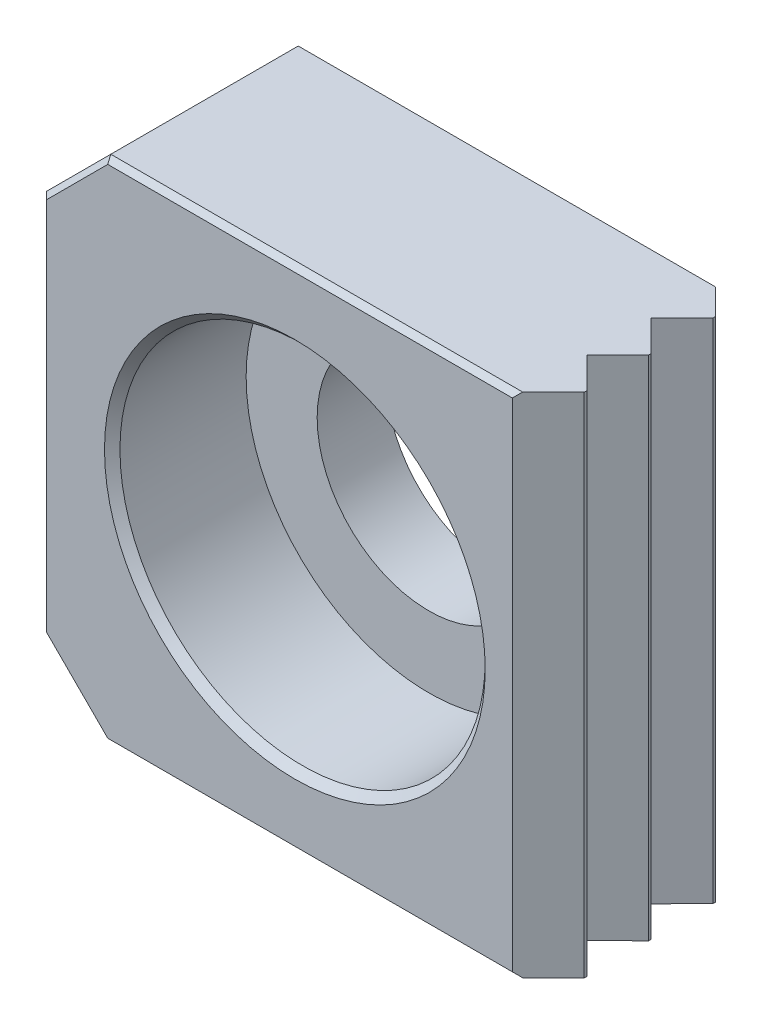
ISO-10303-21;
HEADER;
FILE_DESCRIPTION(('STEP AP214'),'2;1');
FILE_NAME('part.step','',(''),(''),'','','');
FILE_SCHEMA(('AUTOMOTIVE_DESIGN { 1 0 10303 214 1 1 1 1 }'));
ENDSEC;
DATA;
#1=APPLICATION_CONTEXT('core data for automotive mechanical design processes');
#2=APPLICATION_PROTOCOL_DEFINITION('international standard','automotive_design',2000,#1);
#3=PRODUCT_CONTEXT('',#1,'mechanical');
#4=PRODUCT('Part','Part','',(#3));
#5=PRODUCT_RELATED_PRODUCT_CATEGORY('part','',(#4));
#6=PRODUCT_DEFINITION_FORMATION('','',#4);
#7=PRODUCT_DEFINITION_CONTEXT('part definition',#1,'design');
#8=PRODUCT_DEFINITION('design','',#6,#7);
#9=PRODUCT_DEFINITION_SHAPE('','',#8);
#10=(LENGTH_UNIT() NAMED_UNIT(*) SI_UNIT(.MILLI.,.METRE.));
#11=(NAMED_UNIT(*) PLANE_ANGLE_UNIT() SI_UNIT($,.RADIAN.));
#12=(NAMED_UNIT(*) SI_UNIT($,.STERADIAN.) SOLID_ANGLE_UNIT());
#13=UNCERTAINTY_MEASURE_WITH_UNIT(LENGTH_MEASURE(1.E-05),#10,'distance_accuracy_value','');
#14=(GEOMETRIC_REPRESENTATION_CONTEXT(3) GLOBAL_UNCERTAINTY_ASSIGNED_CONTEXT((#13)) GLOBAL_UNIT_ASSIGNED_CONTEXT((#10,
#11,#12)) REPRESENTATION_CONTEXT('',''));
#15=CARTESIAN_POINT('',(0.,0.,0.));
#16=DIRECTION('',(0.,0.,1.));
#17=DIRECTION('',(1.,0.,0.));
#18=AXIS2_PLACEMENT_3D('',#15,#16,#17);
#19=CARTESIAN_POINT('',(0.,0.,3.2436));
#20=DIRECTION('',(0.,0.,1.));
#21=DIRECTION('',(-1.,0.,0.));
#22=AXIS2_PLACEMENT_3D('',#19,#20,#21);
#23=CYLINDRICAL_SURFACE('',#22,9.);
#24=CARTESIAN_POINT('',(0.,0.,9.619));
#25=DIRECTION('',(0.,0.,1.));
#26=DIRECTION('',(-1.,0.,0.));
#27=AXIS2_PLACEMENT_3D('',#24,#25,#26);
#28=CIRCLE('',#27,9.);
#29=CARTESIAN_POINT('',(-9.,0.,9.619));
#30=VERTEX_POINT('',#29);
#31=EDGE_CURVE('E240',#30,#30,#28,.T.);
#32=ORIENTED_EDGE('',*,*,#31,.T.);
#33=EDGE_LOOP('',(#32));
#34=FACE_BOUND('',#33,.T.);
#35=CARTESIAN_POINT('',(0.,0.,3.4));
#36=DIRECTION('',(0.,0.,-1.));
#37=DIRECTION('',(-1.,0.,0.));
#38=AXIS2_PLACEMENT_3D('',#35,#36,#37);
#39=CIRCLE('',#38,9.);
#40=CARTESIAN_POINT('',(-9.,0.,3.4));
#41=VERTEX_POINT('',#40);
#42=EDGE_CURVE('E9',#41,#41,#39,.F.);
#43=ORIENTED_EDGE('',*,*,#42,.F.);
#44=EDGE_LOOP('',(#43));
#45=FACE_BOUND('',#44,.T.);
#46=ADVANCED_FACE('F14',(#34,#45),#23,.F.);
#47=CARTESIAN_POINT('',(12.5,-12.5,10.));
#48=DIRECTION('',(-1.,0.,0.));
#49=DIRECTION('',(0.,-1.,0.));
#50=AXIS2_PLACEMENT_3D('',#47,#48,#49);
#51=PLANE('',#50);
#52=DIRECTION('',(0.,0.,-1.));
#53=VECTOR('',#52,1.);
#54=CARTESIAN_POINT('',(12.5,12.5,10.));
#55=LINE('',#54,#53);
#56=CARTESIAN_POINT('',(12.5,12.5,1.88900123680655));
#57=VERTEX_POINT('',#56);
#58=CARTESIAN_POINT('',(12.5,12.5,1.76199397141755));
#59=VERTEX_POINT('',#58);
#60=EDGE_CURVE('E221',#57,#59,#55,.T.);
#61=ORIENTED_EDGE('',*,*,#60,.F.);
#62=DIRECTION('',(0.,-1.,0.));
#63=VECTOR('',#62,1.);
#64=CARTESIAN_POINT('',(12.5,-12.5,1.88900123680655));
#65=LINE('',#64,#63);
#66=CARTESIAN_POINT('',(12.5,-12.5,1.88900123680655));
#67=VERTEX_POINT('',#66);
#68=EDGE_CURVE('E214',#57,#67,#65,.T.);
#69=ORIENTED_EDGE('',*,*,#68,.T.);
#70=DIRECTION('',(0.,0.,-1.));
#71=VECTOR('',#70,1.);
#72=CARTESIAN_POINT('',(12.5,-12.5,10.));
#73=LINE('',#72,#71);
#74=CARTESIAN_POINT('',(12.5,-12.5,1.76199397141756));
#75=VERTEX_POINT('',#74);
#76=EDGE_CURVE('E217',#67,#75,#73,.T.);
#77=ORIENTED_EDGE('',*,*,#76,.T.);
#78=DIRECTION('',(0.,1.,0.));
#79=VECTOR('',#78,1.);
#80=CARTESIAN_POINT('',(12.5,-12.5,1.76199397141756));
#81=LINE('',#80,#79);
#82=EDGE_CURVE('E201',#75,#59,#81,.T.);
#83=ORIENTED_EDGE('',*,*,#82,.T.);
#84=EDGE_LOOP('',(#61,#69,#77,#83));
#85=FACE_BOUND('',#84,.T.);
#86=ADVANCED_FACE('F16',(#85),#51,.F.);
#87=CARTESIAN_POINT('',(12.5,-12.5,5.06282439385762));
#88=VERTEX_POINT('',#87);
#89=CARTESIAN_POINT('',(12.5,-12.5,4.93717560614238));
#90=VERTEX_POINT('',#89);
#91=EDGE_CURVE('E181',#88,#90,#73,.T.);
#92=ORIENTED_EDGE('',*,*,#91,.T.);
#93=DIRECTION('',(0.,1.,0.));
#94=VECTOR('',#93,1.);
#95=CARTESIAN_POINT('',(12.5,-12.5,4.93717560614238));
#96=LINE('',#95,#94);
#97=CARTESIAN_POINT('',(12.5,12.5,4.93717560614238));
#98=VERTEX_POINT('',#97);
#99=EDGE_CURVE('E211',#90,#98,#96,.T.);
#100=ORIENTED_EDGE('',*,*,#99,.T.);
#101=CARTESIAN_POINT('',(12.5,12.5,5.06282439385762));
#102=VERTEX_POINT('',#101);
#103=EDGE_CURVE('E224',#102,#98,#55,.T.);
#104=ORIENTED_EDGE('',*,*,#103,.F.);
#105=DIRECTION('',(0.,1.,0.));
#106=VECTOR('',#105,1.);
#107=CARTESIAN_POINT('',(12.5,-12.5,5.06282439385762));
#108=LINE('',#107,#106);
#109=EDGE_CURVE('E209',#88,#102,#108,.T.);
#110=ORIENTED_EDGE('',*,*,#109,.F.);
#111=EDGE_LOOP('',(#92,#100,#104,#110));
#112=FACE_BOUND('',#111,.T.);
#113=ADVANCED_FACE('F361',(#112),#51,.F.);
#114=DIRECTION('',(0.,-1.,0.));
#115=VECTOR('',#114,1.);
#116=CARTESIAN_POINT('',(12.5,-12.5,8.11099876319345));
#117=LINE('',#116,#115);
#118=CARTESIAN_POINT('',(12.5,12.5,8.11099876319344));
#119=VERTEX_POINT('',#118);
#120=CARTESIAN_POINT('',(12.5,-12.5,8.11099876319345));
#121=VERTEX_POINT('',#120);
#122=EDGE_CURVE('E170',#119,#121,#117,.T.);
#123=ORIENTED_EDGE('',*,*,#122,.F.);
#124=CARTESIAN_POINT('',(12.5,12.5,8.23800602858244));
#125=VERTEX_POINT('',#124);
#126=EDGE_CURVE('E225',#125,#119,#55,.T.);
#127=ORIENTED_EDGE('',*,*,#126,.F.);
#128=DIRECTION('',(0.,-1.,0.));
#129=VECTOR('',#128,1.);
#130=CARTESIAN_POINT('',(12.5,-12.5,8.23800602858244));
#131=LINE('',#130,#129);
#132=CARTESIAN_POINT('',(12.5,-12.5,8.23800602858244));
#133=VERTEX_POINT('',#132);
#134=EDGE_CURVE('E205',#125,#133,#131,.T.);
#135=ORIENTED_EDGE('',*,*,#134,.T.);
#136=EDGE_CURVE('E220',#133,#121,#73,.T.);
#137=ORIENTED_EDGE('',*,*,#136,.T.);
#138=EDGE_LOOP('',(#123,#127,#135,#137));
#139=FACE_BOUND('',#138,.T.);
#140=ADVANCED_FACE('F359',(#139),#51,.F.);
#141=CARTESIAN_POINT('',(-12.5,12.5,10.));
#142=DIRECTION('',(0.,1.,0.));
#143=DIRECTION('',(-1.,0.,0.));
#144=AXIS2_PLACEMENT_3D('',#141,#142,#143);
#145=PLANE('',#144);
#146=DIRECTION('',(0.,0.,1.));
#147=VECTOR('',#146,1.);
#148=CARTESIAN_POINT('',(-9.325,12.5,10.));
#149=LINE('',#148,#147);
#150=CARTESIAN_POINT('',(-9.325,12.5,0.508));
#151=VERTEX_POINT('',#150);
#152=CARTESIAN_POINT('',(-9.325,12.5,9.746));
#153=VERTEX_POINT('',#152);
#154=EDGE_CURVE('E238',#151,#153,#149,.T.);
#155=ORIENTED_EDGE('',*,*,#154,.T.);
#156=DIRECTION('',(1.,0.,0.));
#157=VECTOR('',#156,1.);
#158=CARTESIAN_POINT('',(-12.5,12.5,9.746));
#159=LINE('',#158,#157);
#160=CARTESIAN_POINT('',(10.9757892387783,12.5,9.746));
#161=VERTEX_POINT('',#160);
#162=EDGE_CURVE('E23',#153,#161,#159,.T.);
#163=ORIENTED_EDGE('',*,*,#162,.T.);
#164=DIRECTION('',(0.710878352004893,0.,-0.703314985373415));
#165=VECTOR('',#164,1.);
#166=CARTESIAN_POINT('',(9.33228776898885,12.5,11.3720154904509));
#167=LINE('',#166,#165);
#168=EDGE_CURVE('E193',#161,#125,#167,.T.);
#169=ORIENTED_EDGE('',*,*,#168,.T.);
#170=ORIENTED_EDGE('',*,*,#126,.T.);
#171=DIRECTION('',(0.703314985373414,0.,0.710878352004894));
#172=VECTOR('',#171,1.);
#173=CARTESIAN_POINT('',(10.976,12.5,6.57060984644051));
#174=LINE('',#173,#172);
#175=CARTESIAN_POINT('',(10.976,12.5,6.57060984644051));
#176=VERTEX_POINT('',#175);
#177=EDGE_CURVE('E195',#176,#119,#174,.T.);
#178=ORIENTED_EDGE('',*,*,#177,.F.);
#179=DIRECTION('',(-0.710878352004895,0.,0.703314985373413));
#180=VECTOR('',#179,1.);
#181=CARTESIAN_POINT('',(12.5635,12.5,5.));
#182=LINE('',#181,#180);
#183=EDGE_CURVE('E160',#102,#176,#182,.T.);
#184=ORIENTED_EDGE('',*,*,#183,.F.);
#185=ORIENTED_EDGE('',*,*,#103,.T.);
#186=DIRECTION('',(-0.710878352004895,0.,-0.703314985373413));
#187=VECTOR('',#186,1.);
#188=CARTESIAN_POINT('',(12.5635,12.5,5.));
#189=LINE('',#188,#187);
#190=CARTESIAN_POINT('',(10.976,12.5,3.42939015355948));
#191=VERTEX_POINT('',#190);
#192=EDGE_CURVE('E164',#98,#191,#189,.T.);
#193=ORIENTED_EDGE('',*,*,#192,.T.);
#194=DIRECTION('',(0.703314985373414,0.,-0.710878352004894));
#195=VECTOR('',#194,1.);
#196=CARTESIAN_POINT('',(10.976,12.5,3.42939015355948));
#197=LINE('',#196,#195);
#198=EDGE_CURVE('E184',#191,#57,#197,.T.);
#199=ORIENTED_EDGE('',*,*,#198,.T.);
#200=ORIENTED_EDGE('',*,*,#60,.T.);
#201=DIRECTION('',(-0.710878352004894,0.,-0.703314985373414));
#202=VECTOR('',#201,1.);
#203=CARTESIAN_POINT('',(12.5635,12.5,1.82481836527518));
#204=LINE('',#203,#202);
#205=CARTESIAN_POINT('',(11.2325207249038,12.5,0.508));
#206=VERTEX_POINT('',#205);
#207=EDGE_CURVE('E190',#59,#206,#204,.T.);
#208=ORIENTED_EDGE('',*,*,#207,.T.);
#209=DIRECTION('',(-1.,0.,0.));
#210=VECTOR('',#209,1.);
#211=CARTESIAN_POINT('',(-9.325,12.5,0.508));
#212=LINE('',#211,#210);
#213=EDGE_CURVE('E271',#206,#151,#212,.T.);
#214=ORIENTED_EDGE('',*,*,#213,.T.);
#215=EDGE_LOOP('',(#155,#163,#169,#170,#178,#184,#185,#193,#199,#200,#208,#214));
#216=FACE_BOUND('',#215,.T.);
#217=ADVANCED_FACE('F297',(#216),#145,.T.);
#218=CARTESIAN_POINT('',(12.5,-12.5,10.));
#219=DIRECTION('',(0.,-1.,0.));
#220=DIRECTION('',(1.,0.,0.));
#221=AXIS2_PLACEMENT_3D('',#218,#219,#220);
#222=PLANE('',#221);
#223=DIRECTION('',(0.710878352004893,0.,-0.703314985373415));
#224=VECTOR('',#223,1.);
#225=CARTESIAN_POINT('',(9.33228776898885,-12.5,11.3720154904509));
#226=LINE('',#225,#224);
#227=CARTESIAN_POINT('',(10.9757892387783,-12.5,9.746));
#228=VERTEX_POINT('',#227);
#229=EDGE_CURVE('E174',#228,#133,#226,.T.);
#230=ORIENTED_EDGE('',*,*,#229,.F.);
#231=DIRECTION('',(-1.,0.,0.));
#232=VECTOR('',#231,1.);
#233=CARTESIAN_POINT('',(12.5,-12.5,9.746));
#234=LINE('',#233,#232);
#235=CARTESIAN_POINT('',(-9.325,-12.5,9.746));
#236=VERTEX_POINT('',#235);
#237=EDGE_CURVE('E273',#228,#236,#234,.T.);
#238=ORIENTED_EDGE('',*,*,#237,.T.);
#239=DIRECTION('',(0.,0.,-1.));
#240=VECTOR('',#239,1.);
#241=CARTESIAN_POINT('',(-9.325,-12.5,0.));
#242=LINE('',#241,#240);
#243=CARTESIAN_POINT('',(-9.325,-12.5,0.508));
#244=VERTEX_POINT('',#243);
#245=EDGE_CURVE('E232',#236,#244,#242,.T.);
#246=ORIENTED_EDGE('',*,*,#245,.T.);
#247=DIRECTION('',(1.,0.,0.));
#248=VECTOR('',#247,1.);
#249=CARTESIAN_POINT('',(10.7190577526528,-12.5,0.508));
#250=LINE('',#249,#248);
#251=CARTESIAN_POINT('',(11.2325207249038,-12.5,0.508));
#252=VERTEX_POINT('',#251);
#253=EDGE_CURVE('E257',#244,#252,#250,.T.);
#254=ORIENTED_EDGE('',*,*,#253,.T.);
#255=DIRECTION('',(-0.710878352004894,0.,-0.703314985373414));
#256=VECTOR('',#255,1.);
#257=CARTESIAN_POINT('',(12.5635,-12.5,1.82481836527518));
#258=LINE('',#257,#256);
#259=EDGE_CURVE('E357',#75,#252,#258,.T.);
#260=ORIENTED_EDGE('',*,*,#259,.F.);
#261=ORIENTED_EDGE('',*,*,#76,.F.);
#262=DIRECTION('',(0.703314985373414,0.,-0.710878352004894));
#263=VECTOR('',#262,1.);
#264=CARTESIAN_POINT('',(10.976,-12.5,3.42939015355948));
#265=LINE('',#264,#263);
#266=CARTESIAN_POINT('',(10.976,-12.5,3.42939015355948));
#267=VERTEX_POINT('',#266);
#268=EDGE_CURVE('E355',#267,#67,#265,.T.);
#269=ORIENTED_EDGE('',*,*,#268,.F.);
#270=DIRECTION('',(-0.710878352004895,0.,-0.703314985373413));
#271=VECTOR('',#270,1.);
#272=CARTESIAN_POINT('',(12.5635,-12.5,5.));
#273=LINE('',#272,#271);
#274=EDGE_CURVE('E182',#90,#267,#273,.T.);
#275=ORIENTED_EDGE('',*,*,#274,.F.);
#276=ORIENTED_EDGE('',*,*,#91,.F.);
#277=DIRECTION('',(-0.710878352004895,0.,0.703314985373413));
#278=VECTOR('',#277,1.);
#279=CARTESIAN_POINT('',(12.5635,-12.5,5.));
#280=LINE('',#279,#278);
#281=CARTESIAN_POINT('',(10.976,-12.5,6.57060984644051));
#282=VERTEX_POINT('',#281);
#283=EDGE_CURVE('E157',#88,#282,#280,.T.);
#284=ORIENTED_EDGE('',*,*,#283,.T.);
#285=DIRECTION('',(0.703314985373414,0.,0.710878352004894));
#286=VECTOR('',#285,1.);
#287=CARTESIAN_POINT('',(10.976,-12.5,6.57060984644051));
#288=LINE('',#287,#286);
#289=EDGE_CURVE('E167',#282,#121,#288,.T.);
#290=ORIENTED_EDGE('',*,*,#289,.T.);
#291=ORIENTED_EDGE('',*,*,#136,.F.);
#292=EDGE_LOOP('',(#230,#238,#246,#254,#260,#261,#269,#275,#276,#284,#290,#291));
#293=FACE_BOUND('',#292,.T.);
#294=ADVANCED_FACE('F178',(#293),#222,.T.);
#295=CARTESIAN_POINT('',(-12.5,12.5,10.));
#296=DIRECTION('',(1.,0.,0.));
#297=DIRECTION('',(0.,1.,0.));
#298=AXIS2_PLACEMENT_3D('',#295,#296,#297);
#299=PLANE('',#298);
#300=DIRECTION('',(0.,0.,1.));
#301=VECTOR('',#300,1.);
#302=CARTESIAN_POINT('',(-12.5,-9.325,10.));
#303=LINE('',#302,#301);
#304=CARTESIAN_POINT('',(-12.5,-9.325,0.508));
#305=VERTEX_POINT('',#304);
#306=CARTESIAN_POINT('',(-12.5,-9.325,9.746));
#307=VERTEX_POINT('',#306);
#308=EDGE_CURVE('E236',#305,#307,#303,.T.);
#309=ORIENTED_EDGE('',*,*,#308,.T.);
#310=DIRECTION('',(0.,1.,0.));
#311=VECTOR('',#310,1.);
#312=CARTESIAN_POINT('',(-12.5,9.325,9.746));
#313=LINE('',#312,#311);
#314=CARTESIAN_POINT('',(-12.5,9.325,9.746));
#315=VERTEX_POINT('',#314);
#316=EDGE_CURVE('E38',#307,#315,#313,.T.);
#317=ORIENTED_EDGE('',*,*,#316,.T.);
#318=DIRECTION('',(0.,0.,-1.));
#319=VECTOR('',#318,1.);
#320=CARTESIAN_POINT('',(-12.5,9.325,0.));
#321=LINE('',#320,#319);
#322=CARTESIAN_POINT('',(-12.5,9.325,0.508));
#323=VERTEX_POINT('',#322);
#324=EDGE_CURVE('E234',#315,#323,#321,.T.);
#325=ORIENTED_EDGE('',*,*,#324,.T.);
#326=DIRECTION('',(0.,-1.,0.));
#327=VECTOR('',#326,1.);
#328=CARTESIAN_POINT('',(-12.5,12.5,0.508));
#329=LINE('',#328,#327);
#330=EDGE_CURVE('E266',#323,#305,#329,.T.);
#331=ORIENTED_EDGE('',*,*,#330,.T.);
#332=EDGE_LOOP('',(#309,#317,#325,#331));
#333=FACE_BOUND('',#332,.T.);
#334=ADVANCED_FACE('F435',(#333),#299,.F.);
#335=CARTESIAN_POINT('',(12.5,-12.5,10.));
#336=DIRECTION('',(0.,0.,1.));
#337=DIRECTION('',(-1.,0.,0.));
#338=AXIS2_PLACEMENT_3D('',#335,#336,#337);
#339=PLANE('',#338);
#340=CARTESIAN_POINT('',(0.,0.,10.));
#341=DIRECTION('',(0.,0.,1.));
#342=DIRECTION('',(-1.,0.,0.));
#343=AXIS2_PLACEMENT_3D('',#340,#341,#342);
#344=CIRCLE('',#343,9.381);
#345=CARTESIAN_POINT('',(-9.381,0.,10.));
#346=VERTEX_POINT('',#345);
#347=EDGE_CURVE('E243',#346,#346,#344,.F.);
#348=ORIENTED_EDGE('',*,*,#347,.T.);
#349=EDGE_LOOP('',(#348));
#350=FACE_BOUND('',#349,.T.);
#351=DIRECTION('',(0.707106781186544,-0.707106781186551,0.));
#352=VECTOR('',#351,1.);
#353=CARTESIAN_POINT('',(1.76710512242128,-23.2328948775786,10.));
#354=LINE('',#353,#352);
#355=CARTESIAN_POINT('',(-12.246,-9.21978975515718,10.));
#356=VERTEX_POINT('',#355);
#357=CARTESIAN_POINT('',(-9.21978975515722,-12.246,10.));
#358=VERTEX_POINT('',#357);
#359=EDGE_CURVE('E282',#356,#358,#354,.T.);
#360=ORIENTED_EDGE('',*,*,#359,.T.);
#361=DIRECTION('',(1.,0.,0.));
#362=VECTOR('',#361,1.);
#363=CARTESIAN_POINT('',(12.5,-12.246,10.));
#364=LINE('',#363,#362);
#365=CARTESIAN_POINT('',(10.7190577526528,-12.246,10.));
#366=VERTEX_POINT('',#365);
#367=EDGE_CURVE('E284',#358,#366,#364,.T.);
#368=ORIENTED_EDGE('',*,*,#367,.T.);
#369=DIRECTION('',(0.,-1.,0.));
#370=VECTOR('',#369,1.);
#371=CARTESIAN_POINT('',(10.7190577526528,-12.5,10.));
#372=LINE('',#371,#370);
#373=CARTESIAN_POINT('',(10.7190577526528,12.246,10.));
#374=VERTEX_POINT('',#373);
#375=EDGE_CURVE('E229',#374,#366,#372,.T.);
#376=ORIENTED_EDGE('',*,*,#375,.F.);
#377=DIRECTION('',(-1.,0.,0.));
#378=VECTOR('',#377,1.);
#379=CARTESIAN_POINT('',(12.5,12.246,10.));
#380=LINE('',#379,#378);
#381=CARTESIAN_POINT('',(-9.21978975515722,12.246,10.));
#382=VERTEX_POINT('',#381);
#383=EDGE_CURVE('E276',#374,#382,#380,.T.);
#384=ORIENTED_EDGE('',*,*,#383,.T.);
#385=DIRECTION('',(-0.707106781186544,-0.707106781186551,0.));
#386=VECTOR('',#385,1.);
#387=CARTESIAN_POINT('',(-10.7328948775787,10.7328948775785,10.));
#388=LINE('',#387,#386);
#389=CARTESIAN_POINT('',(-12.246,9.21978975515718,10.));
#390=VERTEX_POINT('',#389);
#391=EDGE_CURVE('E278',#382,#390,#388,.T.);
#392=ORIENTED_EDGE('',*,*,#391,.T.);
#393=DIRECTION('',(0.,-1.,0.));
#394=VECTOR('',#393,1.);
#395=CARTESIAN_POINT('',(-12.246,-9.325,10.));
#396=LINE('',#395,#394);
#397=EDGE_CURVE('E280',#390,#356,#396,.T.);
#398=ORIENTED_EDGE('',*,*,#397,.T.);
#399=EDGE_LOOP('',(#360,#368,#376,#384,#392,#398));
#400=FACE_BOUND('',#399,.T.);
#401=ADVANCED_FACE('F313',(#350,#400),#339,.T.);
#402=CARTESIAN_POINT('',(12.5,-12.5,0.));
#403=DIRECTION('',(0.,0.,1.));
#404=DIRECTION('',(-1.,0.,0.));
#405=AXIS2_PLACEMENT_3D('',#402,#403,#404);
#406=PLANE('',#405);
#407=CARTESIAN_POINT('',(0.,0.,0.));
#408=DIRECTION('',(0.,0.,-1.));
#409=DIRECTION('',(-1.,0.,0.));
#410=AXIS2_PLACEMENT_3D('',#407,#408,#409);
#411=CIRCLE('',#410,5.5);
#412=CARTESIAN_POINT('',(-5.5,0.,0.));
#413=VERTEX_POINT('',#412);
#414=EDGE_CURVE('E401',#413,#413,#411,.T.);
#415=ORIENTED_EDGE('',*,*,#414,.F.);
#416=EDGE_LOOP('',(#415));
#417=FACE_BOUND('',#416,.T.);
#418=DIRECTION('',(0.,-1.,0.));
#419=VECTOR('',#418,1.);
#420=CARTESIAN_POINT('',(10.7190577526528,-12.5,0.));
#421=LINE('',#420,#419);
#422=CARTESIAN_POINT('',(10.7190577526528,11.992,0.));
#423=VERTEX_POINT('',#422);
#424=CARTESIAN_POINT('',(10.7190577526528,-11.992,0.));
#425=VERTEX_POINT('',#424);
#426=EDGE_CURVE('E226',#423,#425,#421,.T.);
#427=ORIENTED_EDGE('',*,*,#426,.T.);
#428=DIRECTION('',(-1.,0.,0.));
#429=VECTOR('',#428,1.);
#430=CARTESIAN_POINT('',(-9.325,-11.992,0.));
#431=LINE('',#430,#429);
#432=CARTESIAN_POINT('',(-9.11457951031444,-11.992,0.));
#433=VERTEX_POINT('',#432);
#434=EDGE_CURVE('E254',#425,#433,#431,.T.);
#435=ORIENTED_EDGE('',*,*,#434,.T.);
#436=DIRECTION('',(-0.707106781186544,0.707106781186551,0.));
#437=VECTOR('',#436,1.);
#438=CARTESIAN_POINT('',(-12.1407897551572,-8.96578975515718,0.));
#439=LINE('',#438,#437);
#440=CARTESIAN_POINT('',(-11.992,-9.11457951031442,0.));
#441=VERTEX_POINT('',#440);
#442=EDGE_CURVE('E252',#433,#441,#439,.T.);
#443=ORIENTED_EDGE('',*,*,#442,.T.);
#444=DIRECTION('',(0.,1.,0.));
#445=VECTOR('',#444,1.);
#446=CARTESIAN_POINT('',(-11.992,-12.5,0.));
#447=LINE('',#446,#445);
#448=CARTESIAN_POINT('',(-11.992,9.11457951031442,0.));
#449=VERTEX_POINT('',#448);
#450=EDGE_CURVE('E250',#441,#449,#447,.T.);
#451=ORIENTED_EDGE('',*,*,#450,.T.);
#452=DIRECTION('',(0.707106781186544,0.707106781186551,0.));
#453=VECTOR('',#452,1.);
#454=CARTESIAN_POINT('',(-8.96578975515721,12.1407897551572,0.));
#455=LINE('',#454,#453);
#456=CARTESIAN_POINT('',(-9.11457951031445,11.992,0.));
#457=VERTEX_POINT('',#456);
#458=EDGE_CURVE('E248',#449,#457,#455,.T.);
#459=ORIENTED_EDGE('',*,*,#458,.T.);
#460=DIRECTION('',(1.,0.,0.));
#461=VECTOR('',#460,1.);
#462=CARTESIAN_POINT('',(10.7190577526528,11.992,0.));
#463=LINE('',#462,#461);
#464=EDGE_CURVE('E246',#457,#423,#463,.T.);
#465=ORIENTED_EDGE('',*,*,#464,.T.);
#466=EDGE_LOOP('',(#427,#435,#443,#451,#459,#465));
#467=FACE_BOUND('',#466,.T.);
#468=ADVANCED_FACE('F429',(#417,#467),#406,.F.);
#469=CARTESIAN_POINT('',(12.5635,12.5,1.82481836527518));
#470=DIRECTION('',(-0.703314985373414,0.,0.710878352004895));
#471=DIRECTION('',(-0.710878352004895,0.,-0.703314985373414));
#472=AXIS2_PLACEMENT_3D('',#469,#470,#471);
#473=PLANE('',#472);
#474=ORIENTED_EDGE('',*,*,#259,.T.);
#475=DIRECTION('',(-0.581467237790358,0.5752807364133,-0.575280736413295));
#476=VECTOR('',#475,1.);
#477=CARTESIAN_POINT('',(11.3212017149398,-12.587737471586,0.595737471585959));
#478=LINE('',#477,#476);
#479=EDGE_CURVE('E261',#252,#425,#478,.T.);
#480=ORIENTED_EDGE('',*,*,#479,.T.);
#481=ORIENTED_EDGE('',*,*,#426,.F.);
#482=DIRECTION('',(0.581467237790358,0.5752807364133,0.575280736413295));
#483=VECTOR('',#482,1.);
#484=CARTESIAN_POINT('',(11.3212017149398,12.587737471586,0.595737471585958));
#485=LINE('',#484,#483);
#486=EDGE_CURVE('E259',#423,#206,#485,.T.);
#487=ORIENTED_EDGE('',*,*,#486,.T.);
#488=ORIENTED_EDGE('',*,*,#207,.F.);
#489=ORIENTED_EDGE('',*,*,#82,.F.);
#490=EDGE_LOOP('',(#474,#480,#481,#487,#488,#489));
#491=FACE_BOUND('',#490,.T.);
#492=ADVANCED_FACE('F374',(#491),#473,.F.);
#493=CARTESIAN_POINT('',(9.33228776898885,12.5,11.3720154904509));
#494=DIRECTION('',(-0.703314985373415,0.,-0.710878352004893));
#495=DIRECTION('',(0.710878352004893,0.,-0.703314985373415));
#496=AXIS2_PLACEMENT_3D('',#493,#494,#495);
#497=PLANE('',#496);
#498=ORIENTED_EDGE('',*,*,#375,.T.);
#499=DIRECTION('',(-0.58146723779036,0.575280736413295,0.575280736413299));
#500=VECTOR('',#499,1.);
#501=CARTESIAN_POINT('',(11.491131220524,-13.0098590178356,9.23614098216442));
#502=LINE('',#501,#500);
#503=EDGE_CURVE('E288',#366,#228,#502,.F.);
#504=ORIENTED_EDGE('',*,*,#503,.T.);
#505=ORIENTED_EDGE('',*,*,#229,.T.);
#506=ORIENTED_EDGE('',*,*,#134,.F.);
#507=ORIENTED_EDGE('',*,*,#168,.F.);
#508=DIRECTION('',(0.581467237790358,0.575280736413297,-0.575280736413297));
#509=VECTOR('',#508,1.);
#510=CARTESIAN_POINT('',(3.0385275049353,4.6471864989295,17.5988135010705));
#511=LINE('',#510,#509);
#512=EDGE_CURVE('E286',#161,#374,#511,.F.);
#513=ORIENTED_EDGE('',*,*,#512,.T.);
#514=EDGE_LOOP('',(#498,#504,#505,#506,#507,#513));
#515=FACE_BOUND('',#514,.T.);
#516=ADVANCED_FACE('F305',(#515),#497,.F.);
#517=CARTESIAN_POINT('',(10.976,12.5,6.57060984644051));
#518=DIRECTION('',(0.710878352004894,0.,-0.703314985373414));
#519=DIRECTION('',(0.703314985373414,0.,0.710878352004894));
#520=AXIS2_PLACEMENT_3D('',#517,#518,#519);
#521=PLANE('',#520);
#522=ORIENTED_EDGE('',*,*,#122,.T.);
#523=ORIENTED_EDGE('',*,*,#289,.F.);
#524=DIRECTION('',(0.,-1.,0.));
#525=VECTOR('',#524,1.);
#526=CARTESIAN_POINT('',(10.976,12.5,6.57060984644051));
#527=LINE('',#526,#525);
#528=EDGE_CURVE('E153',#176,#282,#527,.T.);
#529=ORIENTED_EDGE('',*,*,#528,.F.);
#530=ORIENTED_EDGE('',*,*,#177,.T.);
#531=EDGE_LOOP('',(#522,#523,#529,#530));
#532=FACE_BOUND('',#531,.T.);
#533=ADVANCED_FACE('F168',(#532),#521,.T.);
#534=CARTESIAN_POINT('',(12.5635,12.5,5.));
#535=DIRECTION('',(0.703314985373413,0.,0.710878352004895));
#536=DIRECTION('',(-0.710878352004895,0.,0.703314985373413));
#537=AXIS2_PLACEMENT_3D('',#534,#535,#536);
#538=PLANE('',#537);
#539=ORIENTED_EDGE('',*,*,#109,.T.);
#540=ORIENTED_EDGE('',*,*,#183,.T.);
#541=ORIENTED_EDGE('',*,*,#528,.T.);
#542=ORIENTED_EDGE('',*,*,#283,.F.);
#543=EDGE_LOOP('',(#539,#540,#541,#542));
#544=FACE_BOUND('',#543,.T.);
#545=ADVANCED_FACE('F155',(#544),#538,.T.);
#546=CARTESIAN_POINT('',(10.976,12.5,3.42939015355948));
#547=DIRECTION('',(-0.710878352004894,0.,-0.703314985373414));
#548=DIRECTION('',(0.703314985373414,0.,-0.710878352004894));
#549=AXIS2_PLACEMENT_3D('',#546,#547,#548);
#550=PLANE('',#549);
#551=ORIENTED_EDGE('',*,*,#198,.F.);
#552=DIRECTION('',(0.,-1.,0.));
#553=VECTOR('',#552,1.);
#554=CARTESIAN_POINT('',(10.976,12.5,3.42939015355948));
#555=LINE('',#554,#553);
#556=EDGE_CURVE('E163',#191,#267,#555,.T.);
#557=ORIENTED_EDGE('',*,*,#556,.T.);
#558=ORIENTED_EDGE('',*,*,#268,.T.);
#559=ORIENTED_EDGE('',*,*,#68,.F.);
#560=EDGE_LOOP('',(#551,#557,#558,#559));
#561=FACE_BOUND('',#560,.T.);
#562=ADVANCED_FACE('F370',(#561),#550,.F.);
#563=CARTESIAN_POINT('',(12.5635,12.5,5.));
#564=DIRECTION('',(-0.703314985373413,0.,0.710878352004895));
#565=DIRECTION('',(-0.710878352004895,0.,-0.703314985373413));
#566=AXIS2_PLACEMENT_3D('',#563,#564,#565);
#567=PLANE('',#566);
#568=ORIENTED_EDGE('',*,*,#274,.T.);
#569=ORIENTED_EDGE('',*,*,#556,.F.);
#570=ORIENTED_EDGE('',*,*,#192,.F.);
#571=ORIENTED_EDGE('',*,*,#99,.F.);
#572=EDGE_LOOP('',(#568,#569,#570,#571));
#573=FACE_BOUND('',#572,.T.);
#574=ADVANCED_FACE('F367',(#573),#567,.F.);
#575=CARTESIAN_POINT('',(-9.325,-12.5,10.));
#576=DIRECTION('',(-0.707106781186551,-0.707106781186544,0.));
#577=DIRECTION('',(0.707106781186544,-0.707106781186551,0.));
#578=AXIS2_PLACEMENT_3D('',#575,#576,#577);
#579=PLANE('',#578);
#580=ORIENTED_EDGE('',*,*,#245,.F.);
#581=DIRECTION('',(-0.707106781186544,0.707106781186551,0.));
#582=VECTOR('',#581,1.);
#583=CARTESIAN_POINT('',(-9.325,-12.5,9.746));
#584=LINE('',#583,#582);
#585=EDGE_CURVE('E290',#236,#307,#584,.T.);
#586=ORIENTED_EDGE('',*,*,#585,.T.);
#587=ORIENTED_EDGE('',*,*,#308,.F.);
#588=DIRECTION('',(0.707106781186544,-0.707106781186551,0.));
#589=VECTOR('',#588,1.);
#590=CARTESIAN_POINT('',(-9.325,-12.5,0.508));
#591=LINE('',#590,#589);
#592=EDGE_CURVE('E263',#305,#244,#591,.T.);
#593=ORIENTED_EDGE('',*,*,#592,.T.);
#594=EDGE_LOOP('',(#580,#586,#587,#593));
#595=FACE_BOUND('',#594,.T.);
#596=ADVANCED_FACE('F325',(#595),#579,.T.);
#597=CARTESIAN_POINT('',(-12.5,9.325,10.));
#598=DIRECTION('',(-0.707106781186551,0.707106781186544,0.));
#599=DIRECTION('',(-0.707106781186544,-0.707106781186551,0.));
#600=AXIS2_PLACEMENT_3D('',#597,#598,#599);
#601=PLANE('',#600);
#602=ORIENTED_EDGE('',*,*,#324,.F.);
#603=DIRECTION('',(0.707106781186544,0.707106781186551,0.));
#604=VECTOR('',#603,1.);
#605=CARTESIAN_POINT('',(-12.5,9.325,9.746));
#606=LINE('',#605,#604);
#607=EDGE_CURVE('E30',#315,#153,#606,.T.);
#608=ORIENTED_EDGE('',*,*,#607,.T.);
#609=ORIENTED_EDGE('',*,*,#154,.F.);
#610=DIRECTION('',(-0.707106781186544,-0.707106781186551,0.));
#611=VECTOR('',#610,1.);
#612=CARTESIAN_POINT('',(-12.5,9.325,0.508));
#613=LINE('',#612,#611);
#614=EDGE_CURVE('E268',#151,#323,#613,.T.);
#615=ORIENTED_EDGE('',*,*,#614,.T.);
#616=EDGE_LOOP('',(#602,#608,#609,#615));
#617=FACE_BOUND('',#616,.T.);
#618=ADVANCED_FACE('F388',(#617),#601,.T.);
#619=CARTESIAN_POINT('',(0.,0.,9.619));
#620=DIRECTION('',(0.,0.,1.));
#621=DIRECTION('',(-1.,0.,0.));
#622=AXIS2_PLACEMENT_3D('',#619,#620,#621);
#623=CONICAL_SURFACE('',#622,9.,0.785398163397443);
#624=ORIENTED_EDGE('',*,*,#347,.F.);
#625=EDGE_LOOP('',(#624));
#626=FACE_BOUND('',#625,.T.);
#627=ORIENTED_EDGE('',*,*,#31,.F.);
#628=EDGE_LOOP('',(#627));
#629=FACE_BOUND('',#628,.T.);
#630=ADVANCED_FACE('F562',(#626,#629),#623,.F.);
#631=CARTESIAN_POINT('',(12.5,11.992,0.));
#632=DIRECTION('',(0.,0.707106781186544,-0.707106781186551));
#633=DIRECTION('',(0.,0.707106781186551,0.707106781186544));
#634=AXIS2_PLACEMENT_3D('',#631,#632,#633);
#635=PLANE('',#634);
#636=ORIENTED_EDGE('',*,*,#486,.F.);
#637=ORIENTED_EDGE('',*,*,#464,.F.);
#638=DIRECTION('',(-0.281084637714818,0.678598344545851,0.678598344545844));
#639=VECTOR('',#638,1.);
#640=CARTESIAN_POINT('',(-7.40684241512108,7.86915794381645,-4.1228420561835));
#641=LINE('',#640,#639);
#642=EDGE_CURVE('E352',#151,#457,#641,.F.);
#643=ORIENTED_EDGE('',*,*,#642,.F.);
#644=ORIENTED_EDGE('',*,*,#213,.F.);
#645=EDGE_LOOP('',(#636,#637,#643,#644));
#646=FACE_BOUND('',#645,.T.);
#647=ADVANCED_FACE('F380',(#646),#635,.T.);
#648=CARTESIAN_POINT('',(-10.5532897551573,10.5532897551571,0.));
#649=DIRECTION('',(-0.5,0.5,-0.707106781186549));
#650=DIRECTION('',(0.816496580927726,0.,-0.577350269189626));
#651=AXIS2_PLACEMENT_3D('',#648,#649,#650);
#652=PLANE('',#651);
#653=ORIENTED_EDGE('',*,*,#642,.T.);
#654=ORIENTED_EDGE('',*,*,#458,.F.);
#655=DIRECTION('',(0.678598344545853,-0.281084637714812,-0.678598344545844));
#656=VECTOR('',#655,1.);
#657=CARTESIAN_POINT('',(-11.6039048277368,8.95382522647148,-0.38809517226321));
#658=LINE('',#657,#656);
#659=EDGE_CURVE('E344',#323,#449,#658,.T.);
#660=ORIENTED_EDGE('',*,*,#659,.F.);
#661=ORIENTED_EDGE('',*,*,#614,.F.);
#662=EDGE_LOOP('',(#653,#654,#660,#661));
#663=FACE_BOUND('',#662,.T.);
#664=ADVANCED_FACE('F386',(#663),#652,.T.);
#665=CARTESIAN_POINT('',(-12.5,12.5,0.508));
#666=DIRECTION('',(0.707106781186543,0.,0.707106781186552));
#667=DIRECTION('',(-0.707106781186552,0.,0.707106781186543));
#668=AXIS2_PLACEMENT_3D('',#665,#666,#667);
#669=PLANE('',#668);
#670=ORIENTED_EDGE('',*,*,#659,.T.);
#671=ORIENTED_EDGE('',*,*,#450,.F.);
#672=DIRECTION('',(0.678598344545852,0.281084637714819,-0.678598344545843));
#673=VECTOR('',#672,1.);
#674=CARTESIAN_POINT('',(-8.33702158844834,-7.60063788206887,-3.65497841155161));
#675=LINE('',#674,#673);
#676=EDGE_CURVE('E342',#305,#441,#675,.T.);
#677=ORIENTED_EDGE('',*,*,#676,.F.);
#678=ORIENTED_EDGE('',*,*,#330,.F.);
#679=EDGE_LOOP('',(#670,#671,#677,#678));
#680=FACE_BOUND('',#679,.T.);
#681=ADVANCED_FACE('F536',(#680),#669,.F.);
#682=CARTESIAN_POINT('',(1.94671024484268,-23.0532897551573,0.));
#683=DIRECTION('',(-0.5,-0.5,-0.707106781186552));
#684=DIRECTION('',(0.816496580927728,0.,-0.577350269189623));
#685=AXIS2_PLACEMENT_3D('',#682,#683,#684);
#686=PLANE('',#685);
#687=ORIENTED_EDGE('',*,*,#676,.T.);
#688=ORIENTED_EDGE('',*,*,#442,.F.);
#689=DIRECTION('',(-0.281084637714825,-0.678598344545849,0.678598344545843));
#690=VECTOR('',#689,1.);
#691=CARTESIAN_POINT('',(-10.3505126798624,-14.9758066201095,2.98380662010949));
#692=LINE('',#691,#690);
#693=EDGE_CURVE('E337',#244,#433,#692,.F.);
#694=ORIENTED_EDGE('',*,*,#693,.F.);
#695=ORIENTED_EDGE('',*,*,#592,.F.);
#696=EDGE_LOOP('',(#687,#688,#694,#695));
#697=FACE_BOUND('',#696,.T.);
#698=ADVANCED_FACE('F341',(#697),#686,.T.);
#699=CARTESIAN_POINT('',(12.5,-11.992,0.));
#700=DIRECTION('',(0.,-0.707106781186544,-0.707106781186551));
#701=DIRECTION('',(0.,0.707106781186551,-0.707106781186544));
#702=AXIS2_PLACEMENT_3D('',#699,#700,#701);
#703=PLANE('',#702);
#704=ORIENTED_EDGE('',*,*,#479,.F.);
#705=ORIENTED_EDGE('',*,*,#253,.F.);
#706=ORIENTED_EDGE('',*,*,#693,.T.);
#707=ORIENTED_EDGE('',*,*,#434,.F.);
#708=EDGE_LOOP('',(#704,#705,#706,#707));
#709=FACE_BOUND('',#708,.T.);
#710=ADVANCED_FACE('F335',(#709),#703,.T.);
#711=CARTESIAN_POINT('',(-12.5,12.5,9.746));
#712=DIRECTION('',(0.,-0.707106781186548,-0.707106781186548));
#713=DIRECTION('',(0.,0.707106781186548,-0.707106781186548));
#714=AXIS2_PLACEMENT_3D('',#711,#712,#713);
#715=PLANE('',#714);
#716=ORIENTED_EDGE('',*,*,#512,.F.);
#717=ORIENTED_EDGE('',*,*,#162,.F.);
#718=DIRECTION('',(0.281084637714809,-0.678598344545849,0.678598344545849));
#719=VECTOR('',#718,1.);
#720=CARTESIAN_POINT('',(-9.57585222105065,13.105610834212,9.14038916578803));
#721=LINE('',#720,#719);
#722=EDGE_CURVE('E310',#382,#153,#721,.F.);
#723=ORIENTED_EDGE('',*,*,#722,.F.);
#724=ORIENTED_EDGE('',*,*,#383,.F.);
#725=EDGE_LOOP('',(#716,#717,#723,#724));
#726=FACE_BOUND('',#725,.T.);
#727=ADVANCED_FACE('F309',(#726),#715,.F.);
#728=CARTESIAN_POINT('',(-10.7328948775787,10.7328948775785,10.));
#729=DIRECTION('',(0.500000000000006,-0.5,-0.707106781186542));
#730=DIRECTION('',(0.816496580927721,0.,0.577350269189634));
#731=AXIS2_PLACEMENT_3D('',#728,#729,#730);
#732=PLANE('',#731);
#733=ORIENTED_EDGE('',*,*,#722,.T.);
#734=ORIENTED_EDGE('',*,*,#607,.F.);
#735=DIRECTION('',(-0.67859834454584,0.281084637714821,-0.678598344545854));
#736=VECTOR('',#735,1.);
#737=CARTESIAN_POINT('',(-11.8378366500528,9.05072295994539,10.4081633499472));
#738=LINE('',#737,#736);
#739=EDGE_CURVE('E346',#390,#315,#738,.T.);
#740=ORIENTED_EDGE('',*,*,#739,.F.);
#741=ORIENTED_EDGE('',*,*,#391,.F.);
#742=EDGE_LOOP('',(#733,#734,#740,#741));
#743=FACE_BOUND('',#742,.T.);
#744=ADVANCED_FACE('F391',(#743),#732,.F.);
#745=CARTESIAN_POINT('',(-12.246,-12.5,10.));
#746=DIRECTION('',(-0.707106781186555,0.,0.70710678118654));
#747=DIRECTION('',(-0.70710678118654,0.,-0.707106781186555));
#748=AXIS2_PLACEMENT_3D('',#745,#746,#747);
#749=PLANE('',#748);
#750=ORIENTED_EDGE('',*,*,#739,.T.);
#751=ORIENTED_EDGE('',*,*,#316,.F.);
#752=DIRECTION('',(-0.67859834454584,-0.281084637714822,-0.678598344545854));
#753=VECTOR('',#752,1.);
#754=CARTESIAN_POINT('',(-12.871679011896,-9.47895448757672,9.37432098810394));
#755=LINE('',#754,#753);
#756=EDGE_CURVE('E397',#356,#307,#755,.T.);
#757=ORIENTED_EDGE('',*,*,#756,.F.);
#758=ORIENTED_EDGE('',*,*,#397,.F.);
#759=EDGE_LOOP('',(#750,#751,#757,#758));
#760=FACE_BOUND('',#759,.T.);
#761=ADVANCED_FACE('F394',(#760),#749,.T.);
#762=CARTESIAN_POINT('',(1.76710512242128,-23.2328948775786,10.));
#763=DIRECTION('',(0.500000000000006,0.5,-0.707106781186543));
#764=DIRECTION('',(0.816496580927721,0.,0.577350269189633));
#765=AXIS2_PLACEMENT_3D('',#762,#763,#764);
#766=PLANE('',#765);
#767=ORIENTED_EDGE('',*,*,#756,.T.);
#768=ORIENTED_EDGE('',*,*,#585,.F.);
#769=DIRECTION('',(0.281084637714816,0.678598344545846,0.67859834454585));
#770=VECTOR('',#769,1.);
#771=CARTESIAN_POINT('',(-10.4474104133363,-15.2097384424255,7.0362615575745));
#772=LINE('',#771,#770);
#773=EDGE_CURVE('E321',#358,#236,#772,.F.);
#774=ORIENTED_EDGE('',*,*,#773,.F.);
#775=ORIENTED_EDGE('',*,*,#359,.F.);
#776=EDGE_LOOP('',(#767,#768,#774,#775));
#777=FACE_BOUND('',#776,.T.);
#778=ADVANCED_FACE('F486',(#777),#766,.F.);
#779=CARTESIAN_POINT('',(12.5,-12.5,9.746));
#780=DIRECTION('',(0.,0.70710678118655,-0.707106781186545));
#781=DIRECTION('',(0.,0.707106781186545,0.70710678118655));
#782=AXIS2_PLACEMENT_3D('',#779,#780,#781);
#783=PLANE('',#782);
#784=ORIENTED_EDGE('',*,*,#503,.F.);
#785=ORIENTED_EDGE('',*,*,#367,.F.);
#786=ORIENTED_EDGE('',*,*,#773,.T.);
#787=ORIENTED_EDGE('',*,*,#237,.F.);
#788=EDGE_LOOP('',(#784,#785,#786,#787));
#789=FACE_BOUND('',#788,.T.);
#790=ADVANCED_FACE('F319',(#789),#783,.F.);
#791=CARTESIAN_POINT('',(0.,0.,3.4));
#792=DIRECTION('',(0.,0.,-1.));
#793=DIRECTION('',(-1.,0.,0.));
#794=AXIS2_PLACEMENT_3D('',#791,#792,#793);
#795=PLANE('',#794);
#796=CARTESIAN_POINT('',(0.,0.,3.4));
#797=DIRECTION('',(0.,0.,-1.));
#798=DIRECTION('',(-1.,0.,0.));
#799=AXIS2_PLACEMENT_3D('',#796,#797,#798);
#800=CIRCLE('',#799,5.5);
#801=CARTESIAN_POINT('',(-5.5,0.,3.4));
#802=VERTEX_POINT('',#801);
#803=EDGE_CURVE('E18',#802,#802,#800,.T.);
#804=ORIENTED_EDGE('',*,*,#803,.T.);
#805=EDGE_LOOP('',(#804));
#806=FACE_BOUND('',#805,.T.);
#807=ORIENTED_EDGE('',*,*,#42,.T.);
#808=EDGE_LOOP('',(#807));
#809=FACE_BOUND('',#808,.T.);
#810=ADVANCED_FACE('F408',(#806,#809),#795,.F.);
#811=CARTESIAN_POINT('',(0.,0.,10.));
#812=DIRECTION('',(0.,0.,-1.));
#813=DIRECTION('',(-1.,0.,0.));
#814=AXIS2_PLACEMENT_3D('',#811,#812,#813);
#815=CYLINDRICAL_SURFACE('',#814,5.5);
#816=ORIENTED_EDGE('',*,*,#414,.T.);
#817=EDGE_LOOP('',(#816));
#818=FACE_BOUND('',#817,.T.);
#819=ORIENTED_EDGE('',*,*,#803,.F.);
#820=EDGE_LOOP('',(#819));
#821=FACE_BOUND('',#820,.T.);
#822=ADVANCED_FACE('F411',(#818,#821),#815,.F.);
#823=CLOSED_SHELL('',(#46,#86,#113,#140,#217,#294,#334,#401,#468,#492,#516,#533,#545,#562,#574,
#596,#618,#630,#647,#664,#681,#698,#710,#727,#744,#761,#778,#790,#810,#822));
#824=MANIFOLD_SOLID_BREP('B1',#823);
#825=ADVANCED_BREP_SHAPE_REPRESENTATION('',(#18,#824),#14);
#826=SHAPE_DEFINITION_REPRESENTATION(#9,#825);
ENDSEC;
END-ISO-10303-21;
